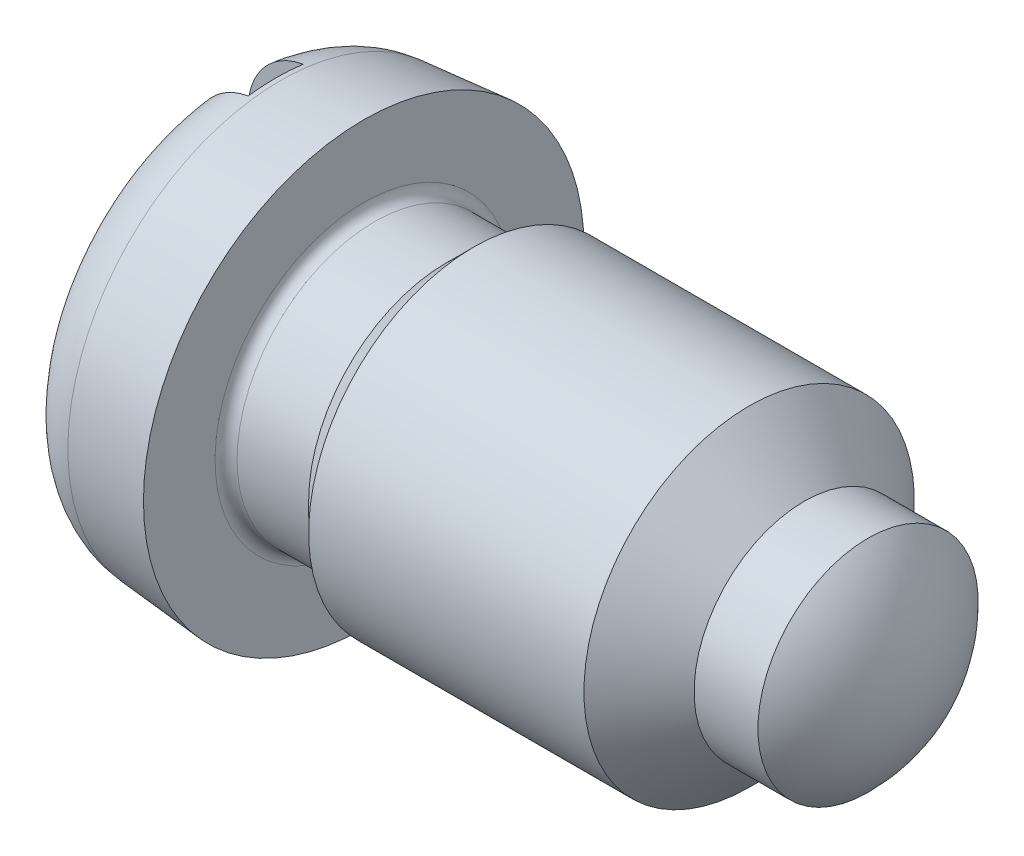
ISO-10303-21;
HEADER;
FILE_DESCRIPTION(('STEP AP214'),'2;1');
FILE_NAME('part.step','',(''),(''),'','','');
FILE_SCHEMA(('AUTOMOTIVE_DESIGN { 1 0 10303 214 1 1 1 1 }'));
ENDSEC;
DATA;
#1=APPLICATION_CONTEXT('core data for automotive mechanical design processes');
#2=APPLICATION_PROTOCOL_DEFINITION('international standard','automotive_design',2000,#1);
#3=PRODUCT_CONTEXT('',#1,'mechanical');
#4=PRODUCT('Part','Part','',(#3));
#5=PRODUCT_RELATED_PRODUCT_CATEGORY('part','',(#4));
#6=PRODUCT_DEFINITION_FORMATION('','',#4);
#7=PRODUCT_DEFINITION_CONTEXT('part definition',#1,'design');
#8=PRODUCT_DEFINITION('design','',#6,#7);
#9=PRODUCT_DEFINITION_SHAPE('','',#8);
#10=(LENGTH_UNIT() NAMED_UNIT(*) SI_UNIT(.MILLI.,.METRE.));
#11=(NAMED_UNIT(*) PLANE_ANGLE_UNIT() SI_UNIT($,.RADIAN.));
#12=(NAMED_UNIT(*) SI_UNIT($,.STERADIAN.) SOLID_ANGLE_UNIT());
#13=UNCERTAINTY_MEASURE_WITH_UNIT(LENGTH_MEASURE(1.E-05),#10,'distance_accuracy_value','');
#14=(GEOMETRIC_REPRESENTATION_CONTEXT(3) GLOBAL_UNCERTAINTY_ASSIGNED_CONTEXT((#13)) GLOBAL_UNIT_ASSIGNED_CONTEXT((#10,
#11,#12)) REPRESENTATION_CONTEXT('',''));
#15=CARTESIAN_POINT('',(0.,0.,0.));
#16=DIRECTION('',(0.,0.,1.));
#17=DIRECTION('',(1.,0.,0.));
#18=AXIS2_PLACEMENT_3D('',#15,#16,#17);
#19=CARTESIAN_POINT('',(0.,0.,0.));
#20=DIRECTION('',(1.,0.,0.));
#21=DIRECTION('',(0.,1.,0.));
#22=AXIS2_PLACEMENT_3D('',#19,#20,#21);
#23=PLANE('',#22);
#24=CARTESIAN_POINT('',(0.,0.,0.));
#25=DIRECTION('',(1.,0.,0.));
#26=DIRECTION('',(0.,1.,0.));
#27=AXIS2_PLACEMENT_3D('',#24,#25,#26);
#28=CIRCLE('',#27,1.33646603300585);
#29=CARTESIAN_POINT('',(0.,-1.31287526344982,0.25));
#30=VERTEX_POINT('',#29);
#31=CARTESIAN_POINT('',(0.,1.31287526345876,0.25));
#32=VERTEX_POINT('',#31);
#33=EDGE_CURVE('E157',#30,#32,#28,.F.);
#34=ORIENTED_EDGE('',*,*,#33,.T.);
#35=DIRECTION('',(0.,-1.,0.));
#36=VECTOR('',#35,1.);
#37=CARTESIAN_POINT('',(0.,2.,0.25));
#38=LINE('',#37,#36);
#39=EDGE_CURVE('E305',#32,#30,#38,.T.);
#40=ORIENTED_EDGE('',*,*,#39,.T.);
#41=EDGE_LOOP('',(#34,#40));
#42=FACE_BOUND('',#41,.T.);
#43=ADVANCED_FACE('F36',(#42),#23,.F.);
#44=CARTESIAN_POINT('',(1.3,0.,0.));
#45=DIRECTION('',(-1.,0.,0.));
#46=DIRECTION('',(0.,-1.,0.));
#47=AXIS2_PLACEMENT_3D('',#44,#45,#46);
#48=CYLINDRICAL_SURFACE('',#47,1.5);
#49=CARTESIAN_POINT('',(4.8,0.,0.));
#50=DIRECTION('',(-1.,0.,0.));
#51=DIRECTION('',(0.,-1.,0.));
#52=AXIS2_PLACEMENT_3D('',#49,#50,#51);
#53=CIRCLE('',#52,1.5);
#54=CARTESIAN_POINT('',(4.8,-1.5,0.));
#55=VERTEX_POINT('',#54);
#56=EDGE_CURVE('E161',#55,#55,#53,.T.);
#57=ORIENTED_EDGE('',*,*,#56,.T.);
#58=EDGE_LOOP('',(#57));
#59=FACE_BOUND('',#58,.T.);
#60=CARTESIAN_POINT('',(2.3,0.,0.));
#61=DIRECTION('',(-1.,0.,0.));
#62=DIRECTION('',(0.,-1.,0.));
#63=AXIS2_PLACEMENT_3D('',#60,#61,#62);
#64=CIRCLE('',#63,1.5);
#65=CARTESIAN_POINT('',(2.3,-1.5,0.));
#66=VERTEX_POINT('',#65);
#67=EDGE_CURVE('E176',#66,#66,#64,.T.);
#68=ORIENTED_EDGE('',*,*,#67,.F.);
#69=EDGE_LOOP('',(#68));
#70=FACE_BOUND('',#69,.T.);
#71=ADVANCED_FACE('F133',(#59,#70),#48,.T.);
#72=CARTESIAN_POINT('',(5.3,0.,0.));
#73=DIRECTION('',(-1.,0.,0.));
#74=DIRECTION('',(0.,-1.,0.));
#75=AXIS2_PLACEMENT_3D('',#72,#73,#74);
#76=CONICAL_SURFACE('',#75,1.,0.785398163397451);
#77=ORIENTED_EDGE('',*,*,#56,.F.);
#78=EDGE_LOOP('',(#77));
#79=FACE_BOUND('',#78,.T.);
#80=CARTESIAN_POINT('',(5.3,0.,0.));
#81=DIRECTION('',(-1.,0.,0.));
#82=DIRECTION('',(0.,-1.,0.));
#83=AXIS2_PLACEMENT_3D('',#80,#81,#82);
#84=CIRCLE('',#83,1.);
#85=CARTESIAN_POINT('',(5.3,-1.,0.));
#86=VERTEX_POINT('',#85);
#87=EDGE_CURVE('E181',#86,#86,#84,.T.);
#88=ORIENTED_EDGE('',*,*,#87,.T.);
#89=EDGE_LOOP('',(#88));
#90=FACE_BOUND('',#89,.T.);
#91=ADVANCED_FACE('F140',(#79,#90),#76,.T.);
#92=CARTESIAN_POINT('',(1.3,0.,0.));
#93=DIRECTION('',(-1.,0.,0.));
#94=DIRECTION('',(0.,-1.,0.));
#95=AXIS2_PLACEMENT_3D('',#92,#93,#94);
#96=CYLINDRICAL_SURFACE('',#95,1.);
#97=ORIENTED_EDGE('',*,*,#87,.F.);
#98=EDGE_LOOP('',(#97));
#99=FACE_BOUND('',#98,.T.);
#100=CARTESIAN_POINT('',(5.87979589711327,0.,0.));
#101=DIRECTION('',(-1.,0.,0.));
#102=DIRECTION('',(0.,-1.,0.));
#103=AXIS2_PLACEMENT_3D('',#100,#101,#102);
#104=CIRCLE('',#103,1.);
#105=CARTESIAN_POINT('',(5.87979589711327,-1.,0.));
#106=VERTEX_POINT('',#105);
#107=EDGE_CURVE('E175',#106,#106,#104,.T.);
#108=ORIENTED_EDGE('',*,*,#107,.T.);
#109=EDGE_LOOP('',(#108));
#110=FACE_BOUND('',#109,.T.);
#111=ADVANCED_FACE('F195',(#99,#110),#96,.T.);
#112=CARTESIAN_POINT('',(4.9,0.,0.));
#113=DIRECTION('',(-1.,0.,0.));
#114=DIRECTION('',(0.,1.,0.));
#115=AXIS2_PLACEMENT_3D('',#112,#113,#114);
#116=SPHERICAL_SURFACE('',#115,1.4);
#117=ORIENTED_EDGE('',*,*,#107,.F.);
#118=EDGE_LOOP('',(#117));
#119=FACE_BOUND('',#118,.T.);
#120=ADVANCED_FACE('F200',(#119),#116,.T.);
#121=CARTESIAN_POINT('',(2.05,0.,0.));
#122=DIRECTION('',(1.,0.,0.));
#123=DIRECTION('',(0.,1.,0.));
#124=AXIS2_PLACEMENT_3D('',#121,#122,#123);
#125=CONICAL_SURFACE('',#124,1.25,0.78539816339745);
#126=ORIENTED_EDGE('',*,*,#67,.T.);
#127=EDGE_LOOP('',(#126));
#128=FACE_BOUND('',#127,.T.);
#129=CARTESIAN_POINT('',(2.05,0.,0.));
#130=DIRECTION('',(-1.,0.,0.));
#131=DIRECTION('',(0.,-1.,0.));
#132=AXIS2_PLACEMENT_3D('',#129,#130,#131);
#133=CIRCLE('',#132,1.25);
#134=CARTESIAN_POINT('',(2.05,-1.25,0.));
#135=VERTEX_POINT('',#134);
#136=EDGE_CURVE('E184',#135,#135,#133,.T.);
#137=ORIENTED_EDGE('',*,*,#136,.F.);
#138=EDGE_LOOP('',(#137));
#139=FACE_BOUND('',#138,.T.);
#140=ADVANCED_FACE('F153',(#128,#139),#125,.T.);
#141=CARTESIAN_POINT('',(0.,0.,0.));
#142=DIRECTION('',(-1.,0.,0.));
#143=DIRECTION('',(0.,-1.,0.));
#144=AXIS2_PLACEMENT_3D('',#141,#142,#143);
#145=CYLINDRICAL_SURFACE('',#144,1.25);
#146=CARTESIAN_POINT('',(1.4,0.,0.));
#147=DIRECTION('',(-1.,0.,0.));
#148=DIRECTION('',(0.,-1.,0.));
#149=AXIS2_PLACEMENT_3D('',#146,#147,#148);
#150=CIRCLE('',#149,1.25);
#151=CARTESIAN_POINT('',(1.4,-1.25,0.));
#152=VERTEX_POINT('',#151);
#153=EDGE_CURVE('E101',#152,#152,#150,.F.);
#154=ORIENTED_EDGE('',*,*,#153,.T.);
#155=EDGE_LOOP('',(#154));
#156=FACE_BOUND('',#155,.T.);
#157=ORIENTED_EDGE('',*,*,#136,.T.);
#158=EDGE_LOOP('',(#157));
#159=FACE_BOUND('',#158,.T.);
#160=ADVANCED_FACE('F115',(#156,#159),#145,.T.);
#161=CARTESIAN_POINT('',(0.,1.31287526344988,-0.25));
#162=VERTEX_POINT('',#161);
#163=CARTESIAN_POINT('',(0.,-1.31287526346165,-0.25));
#164=VERTEX_POINT('',#163);
#165=EDGE_CURVE('E155',#162,#164,#28,.F.);
#166=ORIENTED_EDGE('',*,*,#165,.T.);
#167=DIRECTION('',(0.,-1.,0.));
#168=VECTOR('',#167,1.);
#169=CARTESIAN_POINT('',(0.,2.,-0.25));
#170=LINE('',#169,#168);
#171=EDGE_CURVE('E80',#162,#164,#170,.T.);
#172=ORIENTED_EDGE('',*,*,#171,.F.);
#173=EDGE_LOOP('',(#166,#172));
#174=FACE_BOUND('',#173,.T.);
#175=ADVANCED_FACE('F136',(#174),#23,.F.);
#176=CARTESIAN_POINT('',(0.6,0.,0.));
#177=DIRECTION('',(1.,0.,0.));
#178=DIRECTION('',(0.,1.,0.));
#179=AXIS2_PLACEMENT_3D('',#176,#177,#178);
#180=TOROIDAL_SURFACE('',#179,1.33646603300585,0.6);
#181=CARTESIAN_POINT('',(0.274780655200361,-1.8236242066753,0.25));
#182=CARTESIAN_POINT('',(0.246412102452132,-1.80515338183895,0.25));
#183=CARTESIAN_POINT('',(0.219592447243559,-1.78425531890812,0.25));
#184=CARTESIAN_POINT('',(0.169833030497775,-1.73822266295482,0.25));
#185=CARTESIAN_POINT('',(0.146898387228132,-1.71308256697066,0.25));
#186=CARTESIAN_POINT('',(0.1055857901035,-1.65933726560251,0.25));
#187=CARTESIAN_POINT('',(0.0872036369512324,-1.63073529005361,0.25));
#188=CARTESIAN_POINT('',(0.0554631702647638,-1.5708806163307,0.25));
#189=CARTESIAN_POINT('',(0.0421035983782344,-1.539628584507,0.25));
#190=CARTESIAN_POINT('',(0.0206432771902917,-1.47507749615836,0.25));
#191=CARTESIAN_POINT('',(0.012587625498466,-1.44176345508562,0.25));
#192=CARTESIAN_POINT('',(0.00209404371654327,-1.3742617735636,0.25));
#193=CARTESIAN_POINT('',(-0.000343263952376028,-1.34007403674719,0.25));
#194=CARTESIAN_POINT('',(0.000426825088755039,-1.27125045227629,0.25));
#195=CARTESIAN_POINT('',(0.0037193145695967,-1.23661556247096,0.25));
#196=CARTESIAN_POINT('',(0.0159771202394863,-1.16836487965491,0.25));
#197=CARTESIAN_POINT('',(0.0249429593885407,-1.13474918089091,0.25));
#198=CARTESIAN_POINT('',(0.0484576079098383,-1.06892310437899,0.25));
#199=CARTESIAN_POINT('',(0.0630932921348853,-1.03674374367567,0.25));
#200=CARTESIAN_POINT('',(0.0975178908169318,-0.975266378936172,0.25));
#201=CARTESIAN_POINT('',(0.117307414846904,-0.945968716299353,0.25));
#202=CARTESIAN_POINT('',(0.16167877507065,-0.890885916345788,0.25));
#203=CARTESIAN_POINT('',(0.186295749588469,-0.865129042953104,0.25));
#204=CARTESIAN_POINT('',(0.239578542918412,-0.818201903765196,0.25));
#205=CARTESIAN_POINT('',(0.268244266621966,-0.797031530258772,0.25));
#206=CARTESIAN_POINT('',(0.328272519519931,-0.760396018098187,0.25));
#207=CARTESIAN_POINT('',(0.359573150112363,-0.744829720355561,0.25));
#208=CARTESIAN_POINT('',(0.424438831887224,-0.71950150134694,0.25));
#209=CARTESIAN_POINT('',(0.458002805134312,-0.709736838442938,0.25));
#210=CARTESIAN_POINT('',(0.524586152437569,-0.696826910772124,0.25));
#211=CARTESIAN_POINT('',(0.557544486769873,-0.693366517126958,0.25));
#212=CARTESIAN_POINT('',(0.623554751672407,-0.692262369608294,0.25));
#213=CARTESIAN_POINT('',(0.656606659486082,-0.694617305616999,0.25));
#214=CARTESIAN_POINT('',(0.720611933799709,-0.704833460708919,0.25));
#215=CARTESIAN_POINT('',(0.751597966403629,-0.712492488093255,0.25));
#216=CARTESIAN_POINT('',(0.811898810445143,-0.732772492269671,0.25));
#217=CARTESIAN_POINT('',(0.841213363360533,-0.745394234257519,0.25));
#218=CARTESIAN_POINT('',(0.898189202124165,-0.775523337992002,0.25));
#219=CARTESIAN_POINT('',(0.925787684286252,-0.793149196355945,0.25));
#220=CARTESIAN_POINT('',(0.977832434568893,-0.832561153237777,0.25));
#221=CARTESIAN_POINT('',(1.00227799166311,-0.854348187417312,0.25));
#222=CARTESIAN_POINT('',(1.04866939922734,-0.902723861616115,0.25));
#223=CARTESIAN_POINT('',(1.07041372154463,-0.92950597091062,0.25));
#224=CARTESIAN_POINT('',(1.10925507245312,-0.98625258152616,0.25));
#225=CARTESIAN_POINT('',(1.12635132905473,-1.01621761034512,0.25));
#226=CARTESIAN_POINT('',(1.15587826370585,-1.07945315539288,0.25));
#227=CARTESIAN_POINT('',(1.16815613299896,-1.11279518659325,0.25));
#228=CARTESIAN_POINT('',(1.18693723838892,-1.18106947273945,0.25));
#229=CARTESIAN_POINT('',(1.1934403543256,-1.21600176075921,0.249999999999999));
#230=CARTESIAN_POINT('',(1.20044092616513,-1.28644113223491,0.249999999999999));
#231=CARTESIAN_POINT('',(1.20094258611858,-1.32194779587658,0.249999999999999));
#232=CARTESIAN_POINT('',(1.19588430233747,-1.39252791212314,0.249999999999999));
#233=CARTESIAN_POINT('',(1.19032476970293,-1.42760139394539,0.25));
#234=CARTESIAN_POINT('',(1.17338401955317,-1.49576581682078,0.25));
#235=CARTESIAN_POINT('',(1.16208963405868,-1.52887833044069,0.25));
#236=CARTESIAN_POINT('',(1.13401256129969,-1.59268937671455,0.25));
#237=CARTESIAN_POINT('',(1.11723033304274,-1.62338811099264,0.25));
#238=CARTESIAN_POINT('',(1.07894820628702,-1.68097986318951,0.25));
#239=CARTESIAN_POINT('',(1.05752802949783,-1.70792588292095,0.25));
#240=CARTESIAN_POINT('',(1.01041587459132,-1.75778184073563,0.25));
#241=CARTESIAN_POINT('',(0.984724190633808,-1.78069205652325,0.25));
#242=CARTESIAN_POINT('',(0.930145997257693,-1.82153088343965,0.25));
#243=CARTESIAN_POINT('',(0.901303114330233,-1.83951781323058,0.25));
#244=CARTESIAN_POINT('',(0.840989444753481,-1.87034790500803,0.25));
#245=CARTESIAN_POINT('',(0.80951889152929,-1.88319152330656,0.25));
#246=CARTESIAN_POINT('',(0.745117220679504,-1.90327101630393,0.25));
#247=CARTESIAN_POINT('',(0.712199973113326,-1.91055140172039,0.25));
#248=CARTESIAN_POINT('',(0.645600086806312,-1.91946097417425,0.25));
#249=CARTESIAN_POINT('',(0.611917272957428,-1.92108885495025,0.25));
#250=CARTESIAN_POINT('',(0.544871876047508,-1.91864749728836,0.25));
#251=CARTESIAN_POINT('',(0.511508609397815,-1.91459667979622,0.25));
#252=CARTESIAN_POINT('',(0.445965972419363,-1.90095089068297,0.25));
#253=CARTESIAN_POINT('',(0.413785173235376,-1.89136286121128,0.25));
#254=CARTESIAN_POINT('',(0.363791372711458,-1.87176511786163,0.25));
#255=CARTESIAN_POINT('',(0.345312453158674,-1.86340950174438,0.25));
#256=CARTESIAN_POINT('',(0.309297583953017,-1.84486721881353,0.25));
#257=CARTESIAN_POINT('',(0.291761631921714,-1.83468055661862,0.25));
#258=CARTESIAN_POINT('',(0.274780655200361,-1.8236242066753,0.25));
#259=B_SPLINE_CURVE_WITH_KNOTS('',3,(#181,#182,#183,#184,#185,#186,#187,#188,#189,#190,#191,
#192,#193,#194,#195,#196,#197,#198,#199,#200,#201,#202,#203,#204,#205,#206,#207,#208,#209,#210,
#211,#212,#213,#214,#215,#216,#217,#218,#219,#220,#221,#222,#223,#224,#225,#226,#227,#228,#229,
#230,#231,#232,#233,#234,#235,#236,#237,#238,#239,#240,#241,#242,#243,#244,#245,#246,#247,#248,
#249,#250,#251,#252,#253,#254,#255,#256,#257,#258),.UNSPECIFIED.,.T.,.F.,(4,2,2,2,2,2,2,2,2,2,2,
2,2,2,2,2,2,2,2,2,2,2,2,2,2,2,2,2,2,2,2,2,2,2,2,2,2,2,4),(0.,0.101480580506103,
0.203093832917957,0.304613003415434,0.406106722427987,0.50845263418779,0.610809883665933,
0.71470023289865,0.818600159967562,0.924159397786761,1.02973112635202,1.13610190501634,
1.24247018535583,1.34680873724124,1.45109794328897,1.55001387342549,1.64890752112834,
1.74422508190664,1.83955734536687,1.93736831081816,2.0352012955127,2.13822665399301,
2.24126911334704,2.34735670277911,2.45344649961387,2.55946197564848,2.66547026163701,
2.76991930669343,2.87435961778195,2.97713002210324,3.07989335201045,3.18138079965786,
3.28285924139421,3.38351701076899,3.48419804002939,3.58455322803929,3.68478287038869,
3.74552772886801,3.80627243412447),.UNSPECIFIED.);
#260=CARTESIAN_POINT('',(0.5,-1.91179742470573,0.25));
#261=VERTEX_POINT('',#260);
#262=EDGE_CURVE('E11',#261,#30,#259,.T.);
#263=ORIENTED_EDGE('',*,*,#262,.F.);
#264=CARTESIAN_POINT('',(0.5,0.,0.));
#265=DIRECTION('',(1.,0.,0.));
#266=DIRECTION('',(0.,0.,-1.));
#267=AXIS2_PLACEMENT_3D('',#264,#265,#266);
#268=CIRCLE('',#267,1.92807401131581);
#269=CARTESIAN_POINT('',(0.5,-1.91179742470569,-0.25));
#270=VERTEX_POINT('',#269);
#271=EDGE_CURVE('E47',#270,#261,#268,.F.);
#272=ORIENTED_EDGE('',*,*,#271,.F.);
#273=CARTESIAN_POINT('',(0.274780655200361,-1.8236242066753,-0.25));
#274=CARTESIAN_POINT('',(0.302850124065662,-1.84189666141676,-0.25));
#275=CARTESIAN_POINT('',(0.332476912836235,-1.85782010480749,-0.25));
#276=CARTESIAN_POINT('',(0.394006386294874,-1.88448283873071,-0.25));
#277=CARTESIAN_POINT('',(0.425911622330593,-1.89521620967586,-0.25));
#278=CARTESIAN_POINT('',(0.49106542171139,-1.91116335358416,-0.25));
#279=CARTESIAN_POINT('',(0.524313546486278,-1.91637891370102,-0.25));
#280=CARTESIAN_POINT('',(0.591204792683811,-1.92113959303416,-0.25));
#281=CARTESIAN_POINT('',(0.624847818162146,-1.92068606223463,-0.25));
#282=CARTESIAN_POINT('',(0.691513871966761,-1.91413229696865,-0.25));
#283=CARTESIAN_POINT('',(0.724537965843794,-1.90804289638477,-0.25));
#284=CARTESIAN_POINT('',(0.789097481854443,-1.890411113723,-0.25));
#285=CARTESIAN_POINT('',(0.820632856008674,-1.87886855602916,-0.25));
#286=CARTESIAN_POINT('',(0.881355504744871,-1.85065407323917,-0.25));
#287=CARTESIAN_POINT('',(0.910540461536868,-1.83397716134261,-0.25));
#288=CARTESIAN_POINT('',(0.965713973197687,-1.79598321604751,-0.25));
#289=CARTESIAN_POINT('',(0.991702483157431,-1.77466611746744,-0.25));
#290=CARTESIAN_POINT('',(1.03989067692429,-1.72788939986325,-0.25));
#291=CARTESIAN_POINT('',(1.06207077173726,-1.70240960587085,-0.25));
#292=CARTESIAN_POINT('',(1.10188385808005,-1.64811708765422,-0.25));
#293=CARTESIAN_POINT('',(1.11951669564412,-1.61930425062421,-0.25));
#294=CARTESIAN_POINT('',(1.14991644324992,-1.55888388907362,-0.25));
#295=CARTESIAN_POINT('',(1.16263701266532,-1.52725305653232,-0.25));
#296=CARTESIAN_POINT('',(1.18266472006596,-1.46232290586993,-0.25));
#297=CARTESIAN_POINT('',(1.18997153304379,-1.42902348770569,-0.249999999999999));
#298=CARTESIAN_POINT('',(1.1990757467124,-1.36122512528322,-0.249999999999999));
#299=CARTESIAN_POINT('',(1.2007978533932,-1.32671607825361,-0.249999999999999));
#300=CARTESIAN_POINT('',(1.19852158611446,-1.2578879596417,-0.249999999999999));
#301=CARTESIAN_POINT('',(1.19452272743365,-1.2235689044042,-0.249999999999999));
#302=CARTESIAN_POINT('',(1.18084584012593,-1.15550299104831,-0.249999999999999));
#303=CARTESIAN_POINT('',(1.1710768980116,-1.12177439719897,-0.25));
#304=CARTESIAN_POINT('',(1.14608963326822,-1.05639845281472,-0.25));
#305=CARTESIAN_POINT('',(1.13087072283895,-1.02475132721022,-0.25));
#306=CARTESIAN_POINT('',(1.09517672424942,-0.964015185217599,-0.25));
#307=CARTESIAN_POINT('',(1.07463585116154,-0.934964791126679,-0.25));
#308=CARTESIAN_POINT('',(1.0289468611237,-0.880736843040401,-0.25));
#309=CARTESIAN_POINT('',(1.00379831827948,-0.855559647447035,-0.25));
#310=CARTESIAN_POINT('',(0.949690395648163,-0.809995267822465,-0.25));
#311=CARTESIAN_POINT('',(0.920750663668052,-0.789584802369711,-0.25));
#312=CARTESIAN_POINT('',(0.859743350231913,-0.754142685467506,-0.25));
#313=CARTESIAN_POINT('',(0.827676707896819,-0.739109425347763,-0.25));
#314=CARTESIAN_POINT('',(0.762667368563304,-0.715550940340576,-0.25));
#315=CARTESIAN_POINT('',(0.729809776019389,-0.706791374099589,-0.25));
#316=CARTESIAN_POINT('',(0.663065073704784,-0.695254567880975,-0.25));
#317=CARTESIAN_POINT('',(0.629178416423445,-0.692474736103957,-0.25));
#318=CARTESIAN_POINT('',(0.563211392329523,-0.693020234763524,-0.25));
#319=CARTESIAN_POINT('',(0.531128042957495,-0.6960379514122,-0.25));
#320=CARTESIAN_POINT('',(0.467930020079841,-0.707432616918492,-0.25));
#321=CARTESIAN_POINT('',(0.436815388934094,-0.715809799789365,-0.25));
#322=CARTESIAN_POINT('',(0.376446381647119,-0.737546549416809,-0.25));
#323=CARTESIAN_POINT('',(0.347188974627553,-0.750897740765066,-0.25));
#324=CARTESIAN_POINT('',(0.291181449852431,-0.782096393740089,-0.25));
#325=CARTESIAN_POINT('',(0.2644318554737,-0.799944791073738,-0.25));
#326=CARTESIAN_POINT('',(0.212801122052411,-0.840563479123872,-0.25));
#327=CARTESIAN_POINT('',(0.18807630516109,-0.863532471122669,-0.25));
#328=CARTESIAN_POINT('',(0.142632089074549,-0.913140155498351,-0.25));
#329=CARTESIAN_POINT('',(0.121913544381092,-0.93977962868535,-0.25));
#330=CARTESIAN_POINT('',(0.0841798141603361,-0.997238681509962,-0.25));
#331=CARTESIAN_POINT('',(0.067363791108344,-1.02818930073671,-0.25));
#332=CARTESIAN_POINT('',(0.039099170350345,-1.09245311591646,-0.25));
#333=CARTESIAN_POINT('',(0.0276510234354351,-1.12576651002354,-0.25));
#334=CARTESIAN_POINT('',(0.0103722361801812,-1.19421384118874,-0.25));
#335=CARTESIAN_POINT('',(0.00460478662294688,-1.2293637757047,-0.25));
#336=CARTESIAN_POINT('',(-0.000878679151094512,-1.30013265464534,-0.25));
#337=CARTESIAN_POINT('',(-0.000595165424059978,-1.335751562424,-0.25));
#338=CARTESIAN_POINT('',(0.00602927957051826,-1.40603493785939,-0.25));
#339=CARTESIAN_POINT('',(0.0123048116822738,-1.44070555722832,-0.25));
#340=CARTESIAN_POINT('',(0.030688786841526,-1.50847558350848,-0.25));
#341=CARTESIAN_POINT('',(0.0427982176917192,-1.54157472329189,-0.25));
#342=CARTESIAN_POINT('',(0.0722935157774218,-1.60468559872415,-0.25));
#343=CARTESIAN_POINT('',(0.0895922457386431,-1.63473812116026,-0.25));
#344=CARTESIAN_POINT('',(0.129048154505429,-1.6914266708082,-0.25));
#345=CARTESIAN_POINT('',(0.151198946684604,-1.71806711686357,-0.25));
#346=CARTESIAN_POINT('',(0.190498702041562,-1.75782741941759,-0.25));
#347=CARTESIAN_POINT('',(0.20635902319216,-1.77224346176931,-0.25));
#348=CARTESIAN_POINT('',(0.23952762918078,-1.79930107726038,-0.25));
#349=CARTESIAN_POINT('',(0.256835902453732,-1.81194266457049,-0.25));
#350=CARTESIAN_POINT('',(0.274780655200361,-1.8236242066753,-0.25));
#351=B_SPLINE_CURVE_WITH_KNOTS('',3,(#273,#274,#275,#276,#277,#278,#279,#280,#281,#282,#283,
#284,#285,#286,#287,#288,#289,#290,#291,#292,#293,#294,#295,#296,#297,#298,#299,#300,#301,#302,
#303,#304,#305,#306,#307,#308,#309,#310,#311,#312,#313,#314,#315,#316,#317,#318,#319,#320,#321,
#322,#323,#324,#325,#326,#327,#328,#329,#330,#331,#332,#333,#334,#335,#336,#337,#338,#339,#340,
#341,#342,#343,#344,#345,#346,#347,#348,#349,#350),.UNSPECIFIED.,.T.,.F.,(4,2,2,2,2,2,2,2,2,2,2,
2,2,2,2,2,2,2,2,2,2,2,2,2,2,2,2,2,2,2,2,2,2,2,2,2,2,2,4),(0.,0.100401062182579,
0.200916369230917,0.301399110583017,0.401857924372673,0.502124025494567,0.602393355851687,
0.702760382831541,0.803128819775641,0.903998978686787,1.00487255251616,1.10667574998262,
1.20848505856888,1.31166139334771,1.41484647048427,1.5197024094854,1.62456966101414,
1.73080076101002,1.83704168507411,1.94275232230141,2.04843130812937,2.14992147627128,
2.25136764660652,2.34757938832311,2.44379533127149,2.53984998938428,2.6359246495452,
2.73671855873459,2.83753394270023,2.9427139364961,3.04790276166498,3.1542488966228,
3.26058677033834,3.36577714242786,3.4709853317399,3.57451735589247,3.67791391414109,
3.74210061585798,3.8062868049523),.UNSPECIFIED.);
#352=EDGE_CURVE('E77',#164,#270,#351,.T.);
#353=ORIENTED_EDGE('',*,*,#352,.F.);
#354=ORIENTED_EDGE('',*,*,#165,.F.);
#355=CARTESIAN_POINT('',(0.256477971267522,0.80668793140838,-0.25));
#356=CARTESIAN_POINT('',(0.283073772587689,0.78724526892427,-0.25));
#357=CARTESIAN_POINT('',(0.311256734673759,0.769944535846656,-0.25));
#358=CARTESIAN_POINT('',(0.370114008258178,0.740229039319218,-0.25));
#359=CARTESIAN_POINT('',(0.400789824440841,0.727817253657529,-0.25));
#360=CARTESIAN_POINT('',(0.463871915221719,0.708374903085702,-0.25));
#361=CARTESIAN_POINT('',(0.496281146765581,0.701353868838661,-0.25));
#362=CARTESIAN_POINT('',(0.561820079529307,0.693064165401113,-0.25));
#363=CARTESIAN_POINT('',(0.59494950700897,0.691793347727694,-0.25));
#364=CARTESIAN_POINT('',(0.659868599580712,0.695008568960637,-0.25));
#365=CARTESIAN_POINT('',(0.691667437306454,0.699313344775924,-0.25));
#366=CARTESIAN_POINT('',(0.754098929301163,0.713169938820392,-0.25));
#367=CARTESIAN_POINT('',(0.784731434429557,0.722722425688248,-0.25));
#368=CARTESIAN_POINT('',(0.844220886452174,0.74676075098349,-0.25));
#369=CARTESIAN_POINT('',(0.873064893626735,0.761278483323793,-0.25));
#370=CARTESIAN_POINT('',(0.928072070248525,0.794719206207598,-0.25));
#371=CARTESIAN_POINT('',(0.954234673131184,0.813643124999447,-0.25));
#372=CARTESIAN_POINT('',(1.00455764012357,0.856403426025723,-0.25));
#373=CARTESIAN_POINT('',(1.02854601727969,0.880442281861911,-0.25));
#374=CARTESIAN_POINT('',(1.07233969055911,0.932069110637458,-0.25));
#375=CARTESIAN_POINT('',(1.09214414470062,0.959657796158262,-0.25));
#376=CARTESIAN_POINT('',(1.1277806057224,1.01880991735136,-0.25));
#377=CARTESIAN_POINT('',(1.14342273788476,1.05048797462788,-0.25));
#378=CARTESIAN_POINT('',(1.16921417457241,1.11600811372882,-0.25));
#379=CARTESIAN_POINT('',(1.17936312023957,1.14985033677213,-0.25));
#380=CARTESIAN_POINT('',(1.19390640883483,1.21901855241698,-0.25));
#381=CARTESIAN_POINT('',(1.198256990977,1.25435377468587,-0.249999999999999));
#382=CARTESIAN_POINT('',(1.20088701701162,1.32525082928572,-0.249999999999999));
#383=CARTESIAN_POINT('',(1.19916675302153,1.36081265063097,-0.249999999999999));
#384=CARTESIAN_POINT('',(1.18971168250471,1.4306918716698,-0.249999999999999));
#385=CARTESIAN_POINT('',(1.18204966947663,1.46501910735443,-0.25));
#386=CARTESIAN_POINT('',(1.16097413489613,1.53186104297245,-0.25));
#387=CARTESIAN_POINT('',(1.14756110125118,1.56437589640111,-0.25));
#388=CARTESIAN_POINT('',(1.11560510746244,1.62610187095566,-0.25));
#389=CARTESIAN_POINT('',(1.097149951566,1.65535845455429,-0.25));
#390=CARTESIAN_POINT('',(1.05552533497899,1.71030063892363,-0.25));
#391=CARTESIAN_POINT('',(1.03235623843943,1.73598651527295,-0.25));
#392=CARTESIAN_POINT('',(0.982310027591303,1.7826880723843,-0.25));
#393=CARTESIAN_POINT('',(0.955488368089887,1.80376319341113,-0.25));
#394=CARTESIAN_POINT('',(0.89865976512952,1.8410604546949,-0.25));
#395=CARTESIAN_POINT('',(0.868652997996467,1.85728286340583,-0.25));
#396=CARTESIAN_POINT('',(0.806611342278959,1.88426128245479,-0.25));
#397=CARTESIAN_POINT('',(0.774598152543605,1.89506720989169,-0.25));
#398=CARTESIAN_POINT('',(0.709207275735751,1.91112053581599,-0.25));
#399=CARTESIAN_POINT('',(0.675829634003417,1.91636811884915,-0.25));
#400=CARTESIAN_POINT('',(0.608837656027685,1.92113717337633,-0.25));
#401=CARTESIAN_POINT('',(0.575225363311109,1.92068739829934,-0.25));
#402=CARTESIAN_POINT('',(0.508554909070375,1.91414489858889,-0.25));
#403=CARTESIAN_POINT('',(0.475496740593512,1.90805224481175,-0.25));
#404=CARTESIAN_POINT('',(0.410905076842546,1.89041194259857,-0.25));
#405=CARTESIAN_POINT('',(0.379370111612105,1.87886967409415,-0.25));
#406=CARTESIAN_POINT('',(0.318677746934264,1.85066978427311,-0.25));
#407=CARTESIAN_POINT('',(0.289520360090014,1.83401213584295,-0.25));
#408=CARTESIAN_POINT('',(0.234312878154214,1.79600861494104,-0.25));
#409=CARTESIAN_POINT('',(0.208272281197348,1.77464894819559,-0.25));
#410=CARTESIAN_POINT('',(0.160116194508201,1.72788872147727,-0.25));
#411=CARTESIAN_POINT('',(0.138000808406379,1.70248805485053,-0.25));
#412=CARTESIAN_POINT('',(0.0981483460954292,1.64818018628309,-0.25));
#413=CARTESIAN_POINT('',(0.0804433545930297,1.61924944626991,-0.25));
#414=CARTESIAN_POINT('',(0.0500800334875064,1.5588521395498,-0.25));
#415=CARTESIAN_POINT('',(0.037421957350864,1.52738544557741,-0.25));
#416=CARTESIAN_POINT('',(0.0173499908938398,1.4624295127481,-0.25));
#417=CARTESIAN_POINT('',(0.00999744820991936,1.42892132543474,-0.25));
#418=CARTESIAN_POINT('',(0.00093202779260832,1.36115298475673,-0.25));
#419=CARTESIAN_POINT('',(-0.000780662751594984,1.32689280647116,-0.25));
#420=CARTESIAN_POINT('',(0.001450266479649,1.25804055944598,-0.25));
#421=CARTESIAN_POINT('',(0.005479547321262,1.22345127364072,-0.25));
#422=CARTESIAN_POINT('',(0.019195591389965,1.15540432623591,-0.25));
#423=CARTESIAN_POINT('',(0.0288841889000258,1.12194703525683,-0.25));
#424=CARTESIAN_POINT('',(0.0538243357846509,1.05655247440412,-0.25));
#425=CARTESIAN_POINT('',(0.0691636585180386,1.0246487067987,-0.25));
#426=CARTESIAN_POINT('',(0.104937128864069,0.963866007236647,-0.25));
#427=CARTESIAN_POINT('',(0.125366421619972,0.934984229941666,-0.25));
#428=CARTESIAN_POINT('',(0.164028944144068,0.889058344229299,-0.25));
#429=CARTESIAN_POINT('',(0.181121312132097,0.871041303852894,-0.25));
#430=CARTESIAN_POINT('',(0.217335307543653,0.837174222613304,-0.25));
#431=CARTESIAN_POINT('',(0.236456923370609,0.821324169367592,-0.25));
#432=CARTESIAN_POINT('',(0.256477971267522,0.80668793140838,-0.25));
#433=B_SPLINE_CURVE_WITH_KNOTS('',3,(#355,#356,#357,#358,#359,#360,#361,#362,#363,#364,#365,
#366,#367,#368,#369,#370,#371,#372,#373,#374,#375,#376,#377,#378,#379,#380,#381,#382,#383,#384,
#385,#386,#387,#388,#389,#390,#391,#392,#393,#394,#395,#396,#397,#398,#399,#400,#401,#402,#403,
#404,#405,#406,#407,#408,#409,#410,#411,#412,#413,#414,#415,#416,#417,#418,#419,#420,#421,#422,
#423,#424,#425,#426,#427,#428,#429,#430,#431,#432),.UNSPECIFIED.,.T.,.F.,(4,2,2,2,2,2,2,2,2,2,2,
2,2,2,2,2,2,2,2,2,2,2,2,2,2,2,2,2,2,2,2,2,2,2,2,2,2,2,4),(0.,0.0987501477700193,
0.19756035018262,0.296544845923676,0.39549235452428,0.491302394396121,0.587124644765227,
0.68357433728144,0.780044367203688,0.881471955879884,0.9829199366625,1.08841286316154,
1.19391268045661,1.30020428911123,1.40649078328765,1.51149532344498,1.61649095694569,
1.71976342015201,1.82302790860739,1.92487039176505,2.02670723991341,2.12758748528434,
2.22846438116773,2.32883237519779,2.42919910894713,2.52946696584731,2.62973535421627,
2.73030191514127,2.83087113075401,2.93215189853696,3.03343775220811,3.13587677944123,
3.23831920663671,3.34230600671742,3.44632652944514,3.5520360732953,3.65764517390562,
3.73198370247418,3.80632180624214),.UNSPECIFIED.);
#434=CARTESIAN_POINT('',(0.500000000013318,1.911797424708,-0.25));
#435=VERTEX_POINT('',#434);
#436=EDGE_CURVE('E100',#435,#162,#433,.T.);
#437=ORIENTED_EDGE('',*,*,#436,.F.);
#438=CARTESIAN_POINT('',(0.5,1.91179742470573,0.25));
#439=VERTEX_POINT('',#438);
#440=EDGE_CURVE('E90',#439,#435,#268,.F.);
#441=ORIENTED_EDGE('',*,*,#440,.F.);
#442=CARTESIAN_POINT('',(0.256477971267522,0.80668793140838,0.25));
#443=CARTESIAN_POINT('',(0.228114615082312,0.82742562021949,0.25));
#444=CARTESIAN_POINT('',(0.201516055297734,0.850630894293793,0.25));
#445=CARTESIAN_POINT('',(0.152571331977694,0.901208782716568,0.25));
#446=CARTESIAN_POINT('',(0.130232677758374,0.928588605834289,0.25));
#447=CARTESIAN_POINT('',(0.0904534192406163,0.986651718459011,0.25));
#448=CARTESIAN_POINT('',(0.0730064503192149,1.0173306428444,0.25));
#449=CARTESIAN_POINT('',(0.0434602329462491,1.08114792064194,0.25));
#450=CARTESIAN_POINT('',(0.0313588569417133,1.11428528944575,0.25));
#451=CARTESIAN_POINT('',(0.0127636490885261,1.18244291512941,0.25));
#452=CARTESIAN_POINT('',(0.0063246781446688,1.21747817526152,0.25));
#453=CARTESIAN_POINT('',(-0.000517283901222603,1.28813764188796,0.25));
#454=CARTESIAN_POINT('',(-0.000920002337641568,1.32376187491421,0.25));
#455=CARTESIAN_POINT('',(0.00434800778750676,1.39420239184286,0.25));
#456=CARTESIAN_POINT('',(0.00995817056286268,1.42902319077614,0.25));
#457=CARTESIAN_POINT('',(0.0270441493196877,1.49719541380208,0.25));
#458=CARTESIAN_POINT('',(0.0385194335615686,1.53054697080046,0.25));
#459=CARTESIAN_POINT('',(0.0668053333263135,1.59425150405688,0.25));
#460=CARTESIAN_POINT('',(0.0835255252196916,1.62464463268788,0.25));
#461=CARTESIAN_POINT('',(0.121902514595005,1.6821361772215,0.25));
#462=CARTESIAN_POINT('',(0.14355890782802,1.70923486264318,0.25));
#463=CARTESIAN_POINT('',(0.190851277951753,1.75895715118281,0.25));
#464=CARTESIAN_POINT('',(0.216425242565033,1.78163974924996,0.25));
#465=CARTESIAN_POINT('',(0.271051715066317,1.82233619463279,0.25));
#466=CARTESIAN_POINT('',(0.300104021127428,1.84035031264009,0.25));
#467=CARTESIAN_POINT('',(0.360541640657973,1.87101228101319,0.25));
#468=CARTESIAN_POINT('',(0.391900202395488,1.8837128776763,0.25));
#469=CARTESIAN_POINT('',(0.456312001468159,1.9036344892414,0.25));
#470=CARTESIAN_POINT('',(0.489365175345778,1.91085570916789,0.25));
#471=CARTESIAN_POINT('',(0.556022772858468,1.91957878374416,0.25));
#472=CARTESIAN_POINT('',(0.589622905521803,1.92111345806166,0.25));
#473=CARTESIAN_POINT('',(0.656602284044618,1.91850953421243,0.25));
#474=CARTESIAN_POINT('',(0.689981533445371,1.91437102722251,0.25));
#475=CARTESIAN_POINT('',(0.755513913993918,1.90055444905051,0.25));
#476=CARTESIAN_POINT('',(0.787669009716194,1.89088569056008,0.25));
#477=CARTESIAN_POINT('',(0.849904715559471,1.8662988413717,0.25));
#478=CARTESIAN_POINT('',(0.879985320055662,1.85138073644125,0.25));
#479=CARTESIAN_POINT('',(0.93729624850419,1.8166898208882,0.25));
#480=CARTESIAN_POINT('',(0.964519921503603,1.79690602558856,0.25));
#481=CARTESIAN_POINT('',(1.01528516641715,1.75307523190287,0.25));
#482=CARTESIAN_POINT('',(1.03882665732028,1.72902813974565,0.25));
#483=CARTESIAN_POINT('',(1.08172595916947,1.6771960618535,0.25));
#484=CARTESIAN_POINT('',(1.10105627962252,1.64938832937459,0.25));
#485=CARTESIAN_POINT('',(1.1348299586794,1.59094992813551,0.25));
#486=CARTESIAN_POINT('',(1.14927310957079,1.56031913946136,0.25));
#487=CARTESIAN_POINT('',(1.17303442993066,1.49675978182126,0.25));
#488=CARTESIAN_POINT('',(1.18229654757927,1.46381026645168,0.249999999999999));
#489=CARTESIAN_POINT('',(1.19524406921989,1.39683436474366,0.249999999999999));
#490=CARTESIAN_POINT('',(1.19892909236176,1.36280790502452,0.249999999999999));
#491=CARTESIAN_POINT('',(1.2006801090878,1.29411335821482,0.249999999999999));
#492=CARTESIAN_POINT('',(1.19866316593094,1.25944316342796,0.249999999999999));
#493=CARTESIAN_POINT('',(1.18893397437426,1.19091174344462,0.249999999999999));
#494=CARTESIAN_POINT('',(1.18122120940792,1.1570505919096,0.25));
#495=CARTESIAN_POINT('',(1.1601769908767,1.09051812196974,0.25));
#496=CARTESIAN_POINT('',(1.14675676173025,1.05787487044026,0.25));
#497=CARTESIAN_POINT('',(1.11467775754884,0.995269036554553,0.25));
#498=CARTESIAN_POINT('',(1.09601835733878,0.965306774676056,0.25));
#499=CARTESIAN_POINT('',(1.05376852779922,0.908648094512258,0.25));
#500=CARTESIAN_POINT('',(1.03013402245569,0.88198449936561,0.25));
#501=CARTESIAN_POINT('',(0.978662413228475,0.833068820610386,0.25));
#502=CARTESIAN_POINT('',(0.950825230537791,0.81081681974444,0.25));
#503=CARTESIAN_POINT('',(0.892141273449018,0.771800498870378,0.25));
#504=CARTESIAN_POINT('',(0.861346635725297,0.754957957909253,0.25));
#505=CARTESIAN_POINT('',(0.797264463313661,0.726991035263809,0.25));
#506=CARTESIAN_POINT('',(0.763978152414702,0.715863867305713,0.25));
#507=CARTESIAN_POINT('',(0.697614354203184,0.700248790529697,0.25));
#508=CARTESIAN_POINT('',(0.664607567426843,0.695460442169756,0.25));
#509=CARTESIAN_POINT('',(0.598260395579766,0.691762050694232,0.25));
#510=CARTESIAN_POINT('',(0.564920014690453,0.692851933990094,0.25));
#511=CARTESIAN_POINT('',(0.50030571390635,0.700686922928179,0.25));
#512=CARTESIAN_POINT('',(0.469003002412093,0.707199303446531,0.25));
#513=CARTESIAN_POINT('',(0.40792696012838,0.725286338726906,0.25));
#514=CARTESIAN_POINT('',(0.378151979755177,0.736855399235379,0.25));
#515=CARTESIAN_POINT('',(0.333202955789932,0.758618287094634,0.25));
#516=CARTESIAN_POINT('',(0.317258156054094,0.767262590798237,0.25));
#517=CARTESIAN_POINT('',(0.286211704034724,0.785948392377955,0.25));
#518=CARTESIAN_POINT('',(0.271110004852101,0.795989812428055,0.25));
#519=CARTESIAN_POINT('',(0.256477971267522,0.80668793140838,0.25));
#520=B_SPLINE_CURVE_WITH_KNOTS('',3,(#442,#443,#444,#445,#446,#447,#448,#449,#450,#451,#452,
#453,#454,#455,#456,#457,#458,#459,#460,#461,#462,#463,#464,#465,#466,#467,#468,#469,#470,#471,
#472,#473,#474,#475,#476,#477,#478,#479,#480,#481,#482,#483,#484,#485,#486,#487,#488,#489,#490,
#491,#492,#493,#494,#495,#496,#497,#498,#499,#500,#501,#502,#503,#504,#505,#506,#507,#508,#509,
#510,#511,#512,#513,#514,#515,#516,#517,#518,#519),.UNSPECIFIED.,.T.,.F.,(4,2,2,2,2,2,2,2,2,2,2,
2,2,2,2,2,2,2,2,2,2,2,2,2,2,2,2,2,2,2,2,2,2,2,2,2,2,2,4),(0.,0.105339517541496,
0.210863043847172,0.316248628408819,0.421592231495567,0.527945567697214,0.634303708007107,
0.739600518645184,0.844887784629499,0.948451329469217,1.05200639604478,1.1540654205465,
1.25611852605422,1.35713304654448,1.45814378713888,1.55857063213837,1.65899586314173,
1.75925247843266,1.85950936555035,1.95999470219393,2.06048224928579,2.16160732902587,
2.2627367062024,2.36493999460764,2.46715026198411,2.57085482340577,2.67456879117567,
2.77995861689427,2.88536102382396,2.9917397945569,3.09812056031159,3.20288545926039,
3.30759923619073,3.40714743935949,3.50669439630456,3.60217675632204,3.69755374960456,
3.75189912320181,3.80624147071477),.UNSPECIFIED.);
#521=EDGE_CURVE('E85',#32,#439,#520,.T.);
#522=ORIENTED_EDGE('',*,*,#521,.F.);
#523=ORIENTED_EDGE('',*,*,#33,.F.);
#524=EDGE_LOOP('',(#263,#272,#353,#354,#437,#441,#522,#523));
#525=FACE_BOUND('',#524,.T.);
#526=CARTESIAN_POINT('',(0.547706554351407,0.,0.));
#527=DIRECTION('',(-1.,0.,0.));
#528=DIRECTION('',(0.,-1.,0.));
#529=AXIS2_PLACEMENT_3D('',#526,#527,#528);
#530=CIRCLE('',#529,1.9341828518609);
#531=CARTESIAN_POINT('',(0.547706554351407,-1.9341828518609,0.));
#532=VERTEX_POINT('',#531);
#533=EDGE_CURVE('E156',#532,#532,#530,.F.);
#534=ORIENTED_EDGE('',*,*,#533,.F.);
#535=EDGE_LOOP('',(#534));
#536=FACE_BOUND('',#535,.T.);
#537=ADVANCED_FACE('F94',(#525,#536),#180,.T.);
#538=CARTESIAN_POINT('',(1.3,0.,0.));
#539=DIRECTION('',(1.,0.,0.));
#540=DIRECTION('',(0.,1.,0.));
#541=AXIS2_PLACEMENT_3D('',#538,#539,#540);
#542=CONICAL_SURFACE('',#541,2.,0.0872664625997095);
#543=ORIENTED_EDGE('',*,*,#533,.T.);
#544=EDGE_LOOP('',(#543));
#545=FACE_BOUND('',#544,.T.);
#546=CARTESIAN_POINT('',(1.3,0.,0.));
#547=DIRECTION('',(-1.,0.,0.));
#548=DIRECTION('',(0.,-1.,0.));
#549=AXIS2_PLACEMENT_3D('',#546,#547,#548);
#550=CIRCLE('',#549,2.);
#551=CARTESIAN_POINT('',(1.3,-2.,0.));
#552=VERTEX_POINT('',#551);
#553=EDGE_CURVE('E172',#552,#552,#550,.T.);
#554=ORIENTED_EDGE('',*,*,#553,.T.);
#555=EDGE_LOOP('',(#554));
#556=FACE_BOUND('',#555,.T.);
#557=ADVANCED_FACE('F152',(#545,#556),#542,.T.);
#558=CARTESIAN_POINT('',(1.3,1.5,0.));
#559=DIRECTION('',(-1.,0.,0.));
#560=DIRECTION('',(0.,-1.,0.));
#561=AXIS2_PLACEMENT_3D('',#558,#559,#560);
#562=PLANE('',#561);
#563=CARTESIAN_POINT('',(1.3,0.,0.));
#564=DIRECTION('',(-1.,0.,0.));
#565=DIRECTION('',(0.,-1.,0.));
#566=AXIS2_PLACEMENT_3D('',#563,#564,#565);
#567=CIRCLE('',#566,1.35);
#568=CARTESIAN_POINT('',(1.3,-1.35,0.));
#569=VERTEX_POINT('',#568);
#570=EDGE_CURVE('E103',#569,#569,#567,.T.);
#571=ORIENTED_EDGE('',*,*,#570,.T.);
#572=EDGE_LOOP('',(#571));
#573=FACE_BOUND('',#572,.T.);
#574=ORIENTED_EDGE('',*,*,#553,.F.);
#575=EDGE_LOOP('',(#574));
#576=FACE_BOUND('',#575,.T.);
#577=ADVANCED_FACE('F130',(#573,#576),#562,.F.);
#578=CARTESIAN_POINT('',(1.4,0.,0.));
#579=DIRECTION('',(-1.,0.,0.));
#580=DIRECTION('',(0.,-1.,0.));
#581=AXIS2_PLACEMENT_3D('',#578,#579,#580);
#582=TOROIDAL_SURFACE('',#581,1.35,0.1);
#583=ORIENTED_EDGE('',*,*,#153,.F.);
#584=EDGE_LOOP('',(#583));
#585=FACE_BOUND('',#584,.T.);
#586=ORIENTED_EDGE('',*,*,#570,.F.);
#587=EDGE_LOOP('',(#586));
#588=FACE_BOUND('',#587,.T.);
#589=ADVANCED_FACE('F38',(#585,#588),#582,.F.);
#590=CARTESIAN_POINT('',(0.,2.,0.25));
#591=DIRECTION('',(0.,0.,1.));
#592=DIRECTION('',(1.,0.,0.));
#593=AXIS2_PLACEMENT_3D('',#590,#591,#592);
#594=PLANE('',#593);
#595=ORIENTED_EDGE('',*,*,#262,.T.);
#596=ORIENTED_EDGE('',*,*,#39,.F.);
#597=ORIENTED_EDGE('',*,*,#521,.T.);
#598=DIRECTION('',(0.,-1.,0.));
#599=VECTOR('',#598,1.);
#600=CARTESIAN_POINT('',(0.5,2.,0.25));
#601=LINE('',#600,#599);
#602=EDGE_CURVE('E92',#439,#261,#601,.T.);
#603=ORIENTED_EDGE('',*,*,#602,.T.);
#604=EDGE_LOOP('',(#595,#596,#597,#603));
#605=FACE_BOUND('',#604,.T.);
#606=ADVANCED_FACE('F122',(#605),#594,.F.);
#607=CARTESIAN_POINT('',(0.5,2.,0.25));
#608=DIRECTION('',(1.,0.,0.));
#609=DIRECTION('',(0.,0.,-1.));
#610=AXIS2_PLACEMENT_3D('',#607,#608,#609);
#611=PLANE('',#610);
#612=ORIENTED_EDGE('',*,*,#271,.T.);
#613=ORIENTED_EDGE('',*,*,#602,.F.);
#614=ORIENTED_EDGE('',*,*,#440,.T.);
#615=DIRECTION('',(0.,-1.,0.));
#616=VECTOR('',#615,1.);
#617=CARTESIAN_POINT('',(0.5,2.,-0.25));
#618=LINE('',#617,#616);
#619=EDGE_CURVE('E54',#435,#270,#618,.T.);
#620=ORIENTED_EDGE('',*,*,#619,.T.);
#621=EDGE_LOOP('',(#612,#613,#614,#620));
#622=FACE_BOUND('',#621,.T.);
#623=ADVANCED_FACE('F87',(#622),#611,.F.);
#624=CARTESIAN_POINT('',(0.,2.,-0.25));
#625=DIRECTION('',(0.,0.,-1.));
#626=DIRECTION('',(-1.,0.,0.));
#627=AXIS2_PLACEMENT_3D('',#624,#625,#626);
#628=PLANE('',#627);
#629=ORIENTED_EDGE('',*,*,#352,.T.);
#630=ORIENTED_EDGE('',*,*,#619,.F.);
#631=ORIENTED_EDGE('',*,*,#436,.T.);
#632=ORIENTED_EDGE('',*,*,#171,.T.);
#633=EDGE_LOOP('',(#629,#630,#631,#632));
#634=FACE_BOUND('',#633,.T.);
#635=ADVANCED_FACE('F78',(#634),#628,.F.);
#636=CLOSED_SHELL('',(#43,#71,#91,#111,#120,#140,#160,#175,#537,#557,#577,#589,#606,#623,#635));
#637=MANIFOLD_SOLID_BREP('B2',#636);
#638=ADVANCED_BREP_SHAPE_REPRESENTATION('',(#18,#637),#14);
#639=SHAPE_DEFINITION_REPRESENTATION(#9,#638);
ENDSEC;
END-ISO-10303-21;
